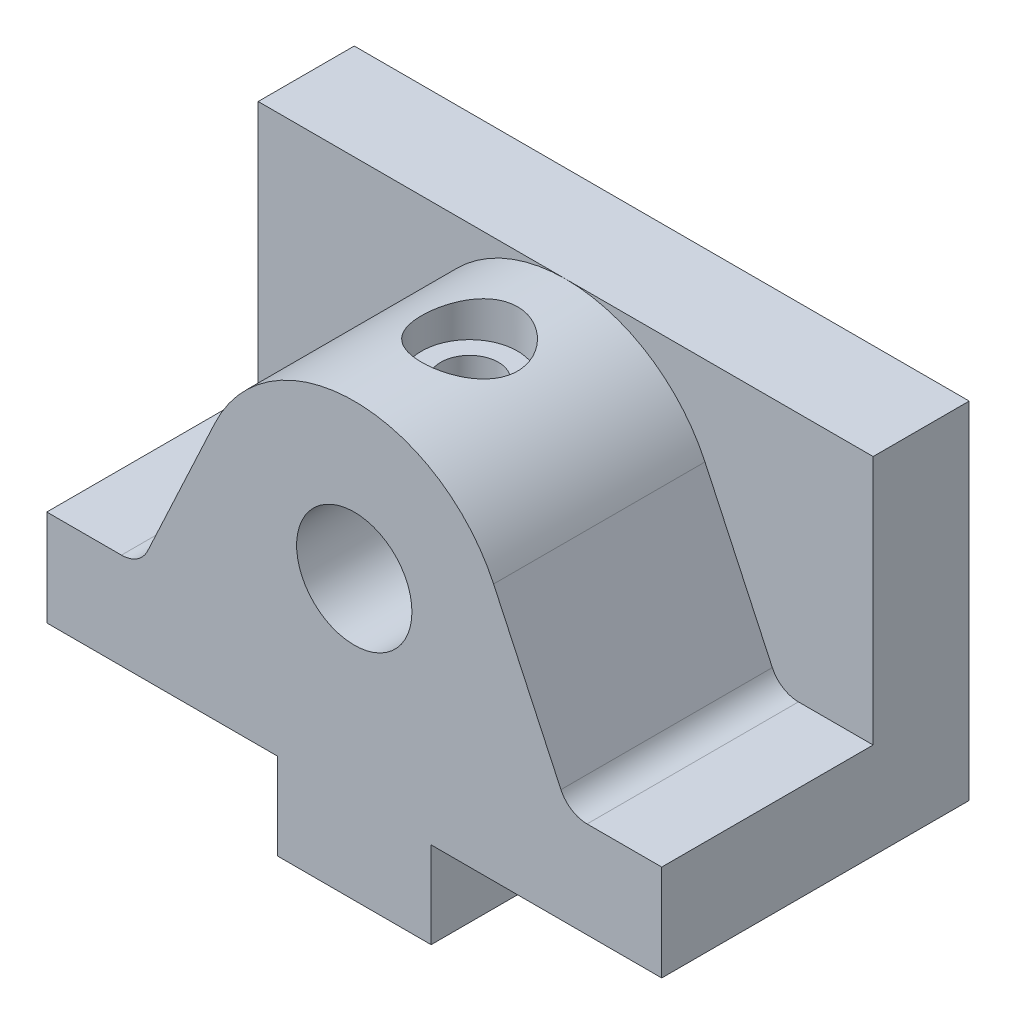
from build123d import *

# Parameters (mm, degrees)
BOSS_EXTRUDE1_DEPTH                      = 32
BOSS_EXTRUDE2_REACH                      = 59.827
SKETCH4_W                                = 16
SKETCH4_H                                = 9
BOSS_EXTRUDE3_DEPTH                      = 32
FILLET1_R                                = 3
SKETCH5_R                                = 6
CUT_EXTRUDE1_DEPTH                       = 24
CBORE_FOR_M10_HEX_HEAD_BOLT1_D           = 6
CBORE_FOR_M10_HEX_HEAD_BOLT1_DEPTH       = 15.999
CBORE_FOR_M10_HEX_HEAD_BOLT1_CBORE_D     = 10
CBORE_FOR_M10_HEX_HEAD_BOLT1_CBORE_DEPTH = 4
CBORE_FOR_M10_HEX_HEAD_BOLT1_TIP         = 1.802581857
F_6_0_6_DIAMETER_HOLE1_D                 = 6
F_6_0_6_DIAMETER_HOLE1_DEPTH             = 16
F_6_0_6_DIAMETER_HOLE1_TIP               = 1.802581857


with BuildPart() as part:
    # Sketch2 → Boss-Extrude1 (new, symmetric)
    with BuildSketch(Plane(origin=(0, 0, 0), x_dir=(0, 0, -1), z_dir=(1, 0, 0))):
        Polygon((-32, 0), (0, 0), (0, 36), (-10, 36), (-10, 10), (-32, 10), align=None)
    extrude(amount=BOSS_EXTRUDE1_DEPTH, both=True)

    # Sketch3 → Boss-Extrude2 (add, up to next)
    with BuildSketch(Plane.XY.offset(32), mode=Mode.PRIVATE) as boss_extrude2_sk1:
        with BuildLine():
            Line((-22.317123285, 10), (-14.500924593, 26.761892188))
            ThreePointArc((-14.500924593, 26.761892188), (0, 36), (14.500924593, 26.761892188))
            Line((14.500924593, 26.761892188), (22.317123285, 10))
            Line((22.317123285, 10), (-22.317123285, 10))
        make_face()
    boss_extrude2_tool1 = extrude(boss_extrude2_sk1.sketch, amount=-BOSS_EXTRUDE2_REACH, mode=Mode.PRIVATE) - part.part
    add(boss_extrude2_tool1.solids().sort_by_distance((0, 20.824715, 32))[0])

    # Sketch4 → Boss-Extrude3 (add, through all)
    with BuildSketch(Plane.XY.offset(32)):
        with Locations((0, -4.5)):
            Rectangle(SKETCH4_W, SKETCH4_H)
    extrude(amount=-BOSS_EXTRUDE3_DEPTH)

    # Fillet1
    fillet1_edges = [part.edges().sort_by_distance(p)[0] for p in [
        (22.317123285, 10, 21),
        (-22.317123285, 10, 21),
    ]]
    fillet(fillet1_edges, radius=FILLET1_R)

    # Sketch5 → Cut-Extrude1 (cut)
    with BuildSketch(Plane.XY.offset(32)):
        with Locations((0, 20)):
            Circle(SKETCH5_R)
    extrude(amount=-CUT_EXTRUDE1_DEPTH, mode=Mode.SUBTRACT)

    # CBORE for M10 Hex Head Bolt1
    with Locations(Plane(origin=(0, 36, 32), x_dir=(-1, 0, 0), z_dir=(0, 1.0, 7.105427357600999e-12))):
        with Locations((0, -12)):
            CounterBoreHole(CBORE_FOR_M10_HEX_HEAD_BOLT1_D / 2, CBORE_FOR_M10_HEX_HEAD_BOLT1_CBORE_D / 2, CBORE_FOR_M10_HEX_HEAD_BOLT1_CBORE_DEPTH, depth=CBORE_FOR_M10_HEX_HEAD_BOLT1_DEPTH)
            with Locations((0, 0, -(CBORE_FOR_M10_HEX_HEAD_BOLT1_DEPTH + CBORE_FOR_M10_HEX_HEAD_BOLT1_TIP / 2))):  # 118° drill point
                Cone(0, CBORE_FOR_M10_HEX_HEAD_BOLT1_D / 2, CBORE_FOR_M10_HEX_HEAD_BOLT1_TIP, mode=Mode.SUBTRACT)

    # 6.0 _6_ Diameter Hole1
    with Locations(Plane.XZ.offset(9)):
        with Locations((0, 24), (0, 8)):
            Hole(F_6_0_6_DIAMETER_HOLE1_D / 2, depth=F_6_0_6_DIAMETER_HOLE1_DEPTH)
            with Locations((0, 0, -(F_6_0_6_DIAMETER_HOLE1_DEPTH + F_6_0_6_DIAMETER_HOLE1_TIP / 2))):  # 118° drill point
                Cone(0, F_6_0_6_DIAMETER_HOLE1_D / 2, F_6_0_6_DIAMETER_HOLE1_TIP, mode=Mode.SUBTRACT)


solid = part.part
